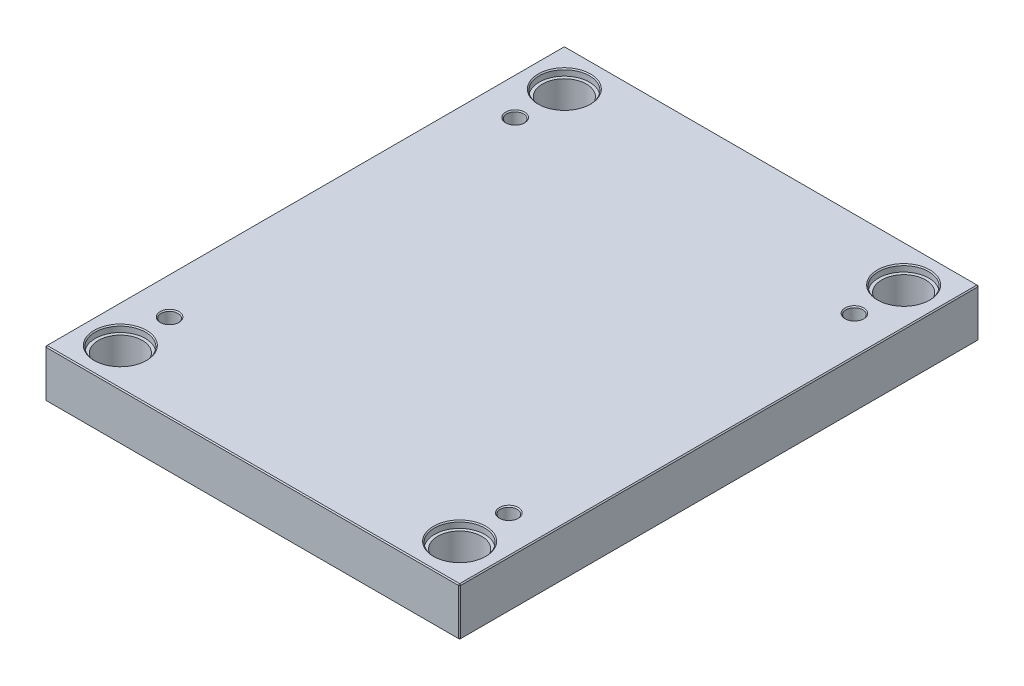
ISO-10303-21;
HEADER;
FILE_DESCRIPTION(('STEP AP214'),'2;1');
FILE_NAME('part.step','',(''),(''),'','','');
FILE_SCHEMA(('AUTOMOTIVE_DESIGN { 1 0 10303 214 1 1 1 1 }'));
ENDSEC;
DATA;
#1=APPLICATION_CONTEXT('core data for automotive mechanical design processes');
#2=APPLICATION_PROTOCOL_DEFINITION('international standard','automotive_design',2000,#1);
#3=PRODUCT_CONTEXT('',#1,'mechanical');
#4=PRODUCT('Part','Part','',(#3));
#5=PRODUCT_RELATED_PRODUCT_CATEGORY('part','',(#4));
#6=PRODUCT_DEFINITION_FORMATION('','',#4);
#7=PRODUCT_DEFINITION_CONTEXT('part definition',#1,'design');
#8=PRODUCT_DEFINITION('design','',#6,#7);
#9=PRODUCT_DEFINITION_SHAPE('','',#8);
#10=(LENGTH_UNIT() NAMED_UNIT(*) SI_UNIT(.MILLI.,.METRE.));
#11=(NAMED_UNIT(*) PLANE_ANGLE_UNIT() SI_UNIT($,.RADIAN.));
#12=(NAMED_UNIT(*) SI_UNIT($,.STERADIAN.) SOLID_ANGLE_UNIT());
#13=UNCERTAINTY_MEASURE_WITH_UNIT(LENGTH_MEASURE(1.E-05),#10,'distance_accuracy_value','');
#14=(GEOMETRIC_REPRESENTATION_CONTEXT(3) GLOBAL_UNCERTAINTY_ASSIGNED_CONTEXT((#13)) GLOBAL_UNIT_ASSIGNED_CONTEXT((#10,
#11,#12)) REPRESENTATION_CONTEXT('',''));
#15=CARTESIAN_POINT('',(0.,0.,0.));
#16=DIRECTION('',(0.,0.,1.));
#17=DIRECTION('',(1.,0.,0.));
#18=AXIS2_PLACEMENT_3D('',#15,#16,#17);
#19=CARTESIAN_POINT('',(-162.,0.,-212.));
#20=DIRECTION('',(0.,1.,0.));
#21=DIRECTION('',(0.,0.,1.));
#22=AXIS2_PLACEMENT_3D('',#19,#20,#21);
#23=CYLINDRICAL_SURFACE('',#22,21.);
#24=CARTESIAN_POINT('',(-162.,0.999999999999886,-212.));
#25=DIRECTION('',(0.,1.,0.));
#26=DIRECTION('',(0.,0.,1.));
#27=AXIS2_PLACEMENT_3D('',#24,#25,#26);
#28=CIRCLE('',#27,21.);
#29=CARTESIAN_POINT('',(-162.,0.999999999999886,-191.));
#30=VERTEX_POINT('',#29);
#31=EDGE_CURVE('E472',#30,#30,#28,.F.);
#32=ORIENTED_EDGE('',*,*,#31,.T.);
#33=EDGE_LOOP('',(#32));
#34=FACE_BOUND('',#33,.T.);
#35=CARTESIAN_POINT('',(-162.,39.7,-212.));
#36=DIRECTION('',(0.,1.,0.));
#37=DIRECTION('',(0.,0.,1.));
#38=AXIS2_PLACEMENT_3D('',#35,#36,#37);
#39=CIRCLE('',#38,21.);
#40=CARTESIAN_POINT('',(-162.,39.7,-191.));
#41=VERTEX_POINT('',#40);
#42=EDGE_CURVE('E221',#41,#41,#39,.F.);
#43=ORIENTED_EDGE('',*,*,#42,.F.);
#44=EDGE_LOOP('',(#43));
#45=FACE_BOUND('',#44,.T.);
#46=ADVANCED_FACE('F16',(#34,#45),#23,.F.);
#47=CARTESIAN_POINT('',(162.,0.,-212.));
#48=DIRECTION('',(0.,1.,0.));
#49=DIRECTION('',(0.,0.,1.));
#50=AXIS2_PLACEMENT_3D('',#47,#48,#49);
#51=CYLINDRICAL_SURFACE('',#50,21.);
#52=CARTESIAN_POINT('',(162.,0.999999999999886,-212.));
#53=DIRECTION('',(0.,1.,0.));
#54=DIRECTION('',(0.,0.,1.));
#55=AXIS2_PLACEMENT_3D('',#52,#53,#54);
#56=CIRCLE('',#55,21.);
#57=CARTESIAN_POINT('',(162.,0.999999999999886,-191.));
#58=VERTEX_POINT('',#57);
#59=EDGE_CURVE('E474',#58,#58,#56,.F.);
#60=ORIENTED_EDGE('',*,*,#59,.T.);
#61=EDGE_LOOP('',(#60));
#62=FACE_BOUND('',#61,.T.);
#63=CARTESIAN_POINT('',(162.,39.7,-212.));
#64=DIRECTION('',(0.,1.,0.));
#65=DIRECTION('',(0.,0.,1.));
#66=AXIS2_PLACEMENT_3D('',#63,#64,#65);
#67=CIRCLE('',#66,21.);
#68=CARTESIAN_POINT('',(162.,39.7,-191.));
#69=VERTEX_POINT('',#68);
#70=EDGE_CURVE('E218',#69,#69,#67,.F.);
#71=ORIENTED_EDGE('',*,*,#70,.F.);
#72=EDGE_LOOP('',(#71));
#73=FACE_BOUND('',#72,.T.);
#74=ADVANCED_FACE('F263',(#62,#73),#51,.F.);
#75=CARTESIAN_POINT('',(162.,0.,212.));
#76=DIRECTION('',(0.,1.,0.));
#77=DIRECTION('',(0.,0.,1.));
#78=AXIS2_PLACEMENT_3D('',#75,#76,#77);
#79=CYLINDRICAL_SURFACE('',#78,21.);
#80=CARTESIAN_POINT('',(162.,0.999999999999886,212.));
#81=DIRECTION('',(0.,1.,0.));
#82=DIRECTION('',(0.,0.,1.));
#83=AXIS2_PLACEMENT_3D('',#80,#81,#82);
#84=CIRCLE('',#83,21.);
#85=CARTESIAN_POINT('',(162.,0.999999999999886,233.));
#86=VERTEX_POINT('',#85);
#87=EDGE_CURVE('E477',#86,#86,#84,.F.);
#88=ORIENTED_EDGE('',*,*,#87,.T.);
#89=EDGE_LOOP('',(#88));
#90=FACE_BOUND('',#89,.T.);
#91=CARTESIAN_POINT('',(162.,39.7,212.));
#92=DIRECTION('',(0.,1.,0.));
#93=DIRECTION('',(0.,0.,1.));
#94=AXIS2_PLACEMENT_3D('',#91,#92,#93);
#95=CIRCLE('',#94,21.);
#96=CARTESIAN_POINT('',(162.,39.7,233.));
#97=VERTEX_POINT('',#96);
#98=EDGE_CURVE('E214',#97,#97,#95,.F.);
#99=ORIENTED_EDGE('',*,*,#98,.F.);
#100=EDGE_LOOP('',(#99));
#101=FACE_BOUND('',#100,.T.);
#102=ADVANCED_FACE('F270',(#90,#101),#79,.F.);
#103=CARTESIAN_POINT('',(-162.,0.,212.));
#104=DIRECTION('',(0.,1.,0.));
#105=DIRECTION('',(0.,0.,1.));
#106=AXIS2_PLACEMENT_3D('',#103,#104,#105);
#107=CYLINDRICAL_SURFACE('',#106,21.);
#108=CARTESIAN_POINT('',(-162.,0.999999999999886,212.));
#109=DIRECTION('',(0.,1.,0.));
#110=DIRECTION('',(0.,0.,1.));
#111=AXIS2_PLACEMENT_3D('',#108,#109,#110);
#112=CIRCLE('',#111,21.);
#113=CARTESIAN_POINT('',(-162.,0.999999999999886,233.));
#114=VERTEX_POINT('',#113);
#115=EDGE_CURVE('E480',#114,#114,#112,.F.);
#116=ORIENTED_EDGE('',*,*,#115,.T.);
#117=EDGE_LOOP('',(#116));
#118=FACE_BOUND('',#117,.T.);
#119=CARTESIAN_POINT('',(-162.,39.7,212.));
#120=DIRECTION('',(0.,1.,0.));
#121=DIRECTION('',(0.,0.,1.));
#122=AXIS2_PLACEMENT_3D('',#119,#120,#121);
#123=CIRCLE('',#122,21.);
#124=CARTESIAN_POINT('',(-162.,39.7,233.));
#125=VERTEX_POINT('',#124);
#126=EDGE_CURVE('E211',#125,#125,#123,.F.);
#127=ORIENTED_EDGE('',*,*,#126,.F.);
#128=EDGE_LOOP('',(#127));
#129=FACE_BOUND('',#128,.T.);
#130=ADVANCED_FACE('F277',(#118,#129),#107,.F.);
#131=CARTESIAN_POINT('',(-198.,46.,248.));
#132=DIRECTION('',(1.,0.,0.));
#133=DIRECTION('',(0.,0.,-1.));
#134=AXIS2_PLACEMENT_3D('',#131,#132,#133);
#135=PLANE('',#134);
#136=DIRECTION('',(0.,-1.,0.));
#137=VECTOR('',#136,1.);
#138=CARTESIAN_POINT('',(-198.,46.,-247.));
#139=LINE('',#138,#137);
#140=CARTESIAN_POINT('',(-198.,45.,-247.));
#141=VERTEX_POINT('',#140);
#142=CARTESIAN_POINT('',(-198.,1.,-247.));
#143=VERTEX_POINT('',#142);
#144=EDGE_CURVE('E487',#141,#143,#139,.T.);
#145=ORIENTED_EDGE('',*,*,#144,.T.);
#146=DIRECTION('',(0.,0.,1.));
#147=VECTOR('',#146,1.);
#148=CARTESIAN_POINT('',(-198.,1.,248.));
#149=LINE('',#148,#147);
#150=CARTESIAN_POINT('',(-198.,1.,247.));
#151=VERTEX_POINT('',#150);
#152=EDGE_CURVE('E490',#143,#151,#149,.T.);
#153=ORIENTED_EDGE('',*,*,#152,.T.);
#154=DIRECTION('',(0.,1.,0.));
#155=VECTOR('',#154,1.);
#156=CARTESIAN_POINT('',(-198.,46.,247.));
#157=LINE('',#156,#155);
#158=CARTESIAN_POINT('',(-198.,45.,247.));
#159=VERTEX_POINT('',#158);
#160=EDGE_CURVE('E485',#151,#159,#157,.T.);
#161=ORIENTED_EDGE('',*,*,#160,.T.);
#162=DIRECTION('',(0.,0.,-1.));
#163=VECTOR('',#162,1.);
#164=CARTESIAN_POINT('',(-198.,45.,-248.));
#165=LINE('',#164,#163);
#166=EDGE_CURVE('E483',#159,#141,#165,.T.);
#167=ORIENTED_EDGE('',*,*,#166,.T.);
#168=EDGE_LOOP('',(#145,#153,#161,#167));
#169=FACE_BOUND('',#168,.T.);
#170=ADVANCED_FACE('F298',(#169),#135,.F.);
#171=CARTESIAN_POINT('',(198.,46.,248.));
#172=DIRECTION('',(0.,0.,-1.));
#173=DIRECTION('',(-1.,0.,0.));
#174=AXIS2_PLACEMENT_3D('',#171,#172,#173);
#175=PLANE('',#174);
#176=DIRECTION('',(-1.,0.,0.));
#177=VECTOR('',#176,1.);
#178=CARTESIAN_POINT('',(-198.,45.,248.));
#179=LINE('',#178,#177);
#180=CARTESIAN_POINT('',(197.,45.,248.));
#181=VERTEX_POINT('',#180);
#182=CARTESIAN_POINT('',(-197.,45.,248.));
#183=VERTEX_POINT('',#182);
#184=EDGE_CURVE('E509',#181,#183,#179,.T.);
#185=ORIENTED_EDGE('',*,*,#184,.T.);
#186=DIRECTION('',(0.,-1.,0.));
#187=VECTOR('',#186,1.);
#188=CARTESIAN_POINT('',(-197.,46.,248.));
#189=LINE('',#188,#187);
#190=CARTESIAN_POINT('',(-197.,1.,248.));
#191=VERTEX_POINT('',#190);
#192=EDGE_CURVE('E515',#183,#191,#189,.T.);
#193=ORIENTED_EDGE('',*,*,#192,.T.);
#194=DIRECTION('',(1.,0.,0.));
#195=VECTOR('',#194,1.);
#196=CARTESIAN_POINT('',(198.,1.,248.));
#197=LINE('',#196,#195);
#198=CARTESIAN_POINT('',(197.,1.,248.));
#199=VERTEX_POINT('',#198);
#200=EDGE_CURVE('E513',#191,#199,#197,.T.);
#201=ORIENTED_EDGE('',*,*,#200,.T.);
#202=DIRECTION('',(0.,1.,0.));
#203=VECTOR('',#202,1.);
#204=CARTESIAN_POINT('',(197.,46.,248.));
#205=LINE('',#204,#203);
#206=EDGE_CURVE('E511',#199,#181,#205,.T.);
#207=ORIENTED_EDGE('',*,*,#206,.T.);
#208=EDGE_LOOP('',(#185,#193,#201,#207));
#209=FACE_BOUND('',#208,.T.);
#210=ADVANCED_FACE('F294',(#209),#175,.F.);
#211=CARTESIAN_POINT('',(198.,46.,248.));
#212=DIRECTION('',(-1.,0.,0.));
#213=DIRECTION('',(0.,0.,1.));
#214=AXIS2_PLACEMENT_3D('',#211,#212,#213);
#215=PLANE('',#214);
#216=DIRECTION('',(0.,0.,-1.));
#217=VECTOR('',#216,1.);
#218=CARTESIAN_POINT('',(198.,1.,248.));
#219=LINE('',#218,#217);
#220=CARTESIAN_POINT('',(198.,1.,247.));
#221=VERTEX_POINT('',#220);
#222=CARTESIAN_POINT('',(198.,1.,-247.));
#223=VERTEX_POINT('',#222);
#224=EDGE_CURVE('E504',#221,#223,#219,.T.);
#225=ORIENTED_EDGE('',*,*,#224,.T.);
#226=DIRECTION('',(0.,1.,0.));
#227=VECTOR('',#226,1.);
#228=CARTESIAN_POINT('',(198.,46.,-247.));
#229=LINE('',#228,#227);
#230=CARTESIAN_POINT('',(198.,45.,-247.));
#231=VERTEX_POINT('',#230);
#232=EDGE_CURVE('E506',#223,#231,#229,.T.);
#233=ORIENTED_EDGE('',*,*,#232,.T.);
#234=DIRECTION('',(0.,0.,1.));
#235=VECTOR('',#234,1.);
#236=CARTESIAN_POINT('',(198.,45.,248.));
#237=LINE('',#236,#235);
#238=CARTESIAN_POINT('',(198.,45.,247.));
#239=VERTEX_POINT('',#238);
#240=EDGE_CURVE('E500',#231,#239,#237,.T.);
#241=ORIENTED_EDGE('',*,*,#240,.T.);
#242=DIRECTION('',(0.,-1.,0.));
#243=VECTOR('',#242,1.);
#244=CARTESIAN_POINT('',(198.,46.,247.));
#245=LINE('',#244,#243);
#246=EDGE_CURVE('E502',#239,#221,#245,.T.);
#247=ORIENTED_EDGE('',*,*,#246,.T.);
#248=EDGE_LOOP('',(#225,#233,#241,#247));
#249=FACE_BOUND('',#248,.T.);
#250=ADVANCED_FACE('F290',(#249),#215,.F.);
#251=CARTESIAN_POINT('',(198.,46.,-248.));
#252=DIRECTION('',(0.,0.,1.));
#253=DIRECTION('',(1.,0.,0.));
#254=AXIS2_PLACEMENT_3D('',#251,#252,#253);
#255=PLANE('',#254);
#256=DIRECTION('',(0.,-1.,0.));
#257=VECTOR('',#256,1.);
#258=CARTESIAN_POINT('',(197.,46.,-248.));
#259=LINE('',#258,#257);
#260=CARTESIAN_POINT('',(197.,45.,-248.));
#261=VERTEX_POINT('',#260);
#262=CARTESIAN_POINT('',(197.,1.,-248.));
#263=VERTEX_POINT('',#262);
#264=EDGE_CURVE('E494',#261,#263,#259,.T.);
#265=ORIENTED_EDGE('',*,*,#264,.T.);
#266=DIRECTION('',(-1.,0.,0.));
#267=VECTOR('',#266,1.);
#268=CARTESIAN_POINT('',(198.,1.,-248.));
#269=LINE('',#268,#267);
#270=CARTESIAN_POINT('',(-197.,1.,-248.));
#271=VERTEX_POINT('',#270);
#272=EDGE_CURVE('E138',#263,#271,#269,.T.);
#273=ORIENTED_EDGE('',*,*,#272,.T.);
#274=DIRECTION('',(0.,1.,0.));
#275=VECTOR('',#274,1.);
#276=CARTESIAN_POINT('',(-197.,46.,-248.));
#277=LINE('',#276,#275);
#278=CARTESIAN_POINT('',(-197.,45.,-248.));
#279=VERTEX_POINT('',#278);
#280=EDGE_CURVE('E496',#271,#279,#277,.T.);
#281=ORIENTED_EDGE('',*,*,#280,.T.);
#282=DIRECTION('',(1.,0.,0.));
#283=VECTOR('',#282,1.);
#284=CARTESIAN_POINT('',(198.,45.,-248.));
#285=LINE('',#284,#283);
#286=EDGE_CURVE('E492',#279,#261,#285,.T.);
#287=ORIENTED_EDGE('',*,*,#286,.T.);
#288=EDGE_LOOP('',(#265,#273,#281,#287));
#289=FACE_BOUND('',#288,.T.);
#290=ADVANCED_FACE('F282',(#289),#255,.F.);
#291=CARTESIAN_POINT('',(0.,46.,0.));
#292=DIRECTION('',(0.,1.,0.));
#293=DIRECTION('',(0.,0.,1.));
#294=AXIS2_PLACEMENT_3D('',#291,#292,#293);
#295=PLANE('',#294);
#296=CARTESIAN_POINT('',(162.,46.,212.));
#297=DIRECTION('',(0.,1.,0.));
#298=DIRECTION('',(0.,0.,1.));
#299=AXIS2_PLACEMENT_3D('',#296,#297,#298);
#300=CIRCLE('',#299,25.);
#301=CARTESIAN_POINT('',(162.,46.,237.));
#302=VERTEX_POINT('',#301);
#303=EDGE_CURVE('E236',#302,#302,#300,.F.);
#304=ORIENTED_EDGE('',*,*,#303,.T.);
#305=EDGE_LOOP('',(#304));
#306=FACE_BOUND('',#305,.T.);
#307=CARTESIAN_POINT('',(-162.,46.,212.));
#308=DIRECTION('',(0.,1.,0.));
#309=DIRECTION('',(0.,0.,1.));
#310=AXIS2_PLACEMENT_3D('',#307,#308,#309);
#311=CIRCLE('',#310,25.);
#312=CARTESIAN_POINT('',(-162.,46.,237.));
#313=VERTEX_POINT('',#312);
#314=EDGE_CURVE('E233',#313,#313,#311,.F.);
#315=ORIENTED_EDGE('',*,*,#314,.T.);
#316=EDGE_LOOP('',(#315));
#317=FACE_BOUND('',#316,.T.);
#318=CARTESIAN_POINT('',(162.,46.,-212.));
#319=DIRECTION('',(0.,1.,0.));
#320=DIRECTION('',(0.,0.,1.));
#321=AXIS2_PLACEMENT_3D('',#318,#319,#320);
#322=CIRCLE('',#321,25.);
#323=CARTESIAN_POINT('',(162.,46.,-187.));
#324=VERTEX_POINT('',#323);
#325=EDGE_CURVE('E230',#324,#324,#322,.F.);
#326=ORIENTED_EDGE('',*,*,#325,.T.);
#327=EDGE_LOOP('',(#326));
#328=FACE_BOUND('',#327,.T.);
#329=CARTESIAN_POINT('',(-162.,46.,-212.));
#330=DIRECTION('',(0.,1.,0.));
#331=DIRECTION('',(0.,0.,1.));
#332=AXIS2_PLACEMENT_3D('',#329,#330,#331);
#333=CIRCLE('',#332,25.);
#334=CARTESIAN_POINT('',(-162.,46.,-187.));
#335=VERTEX_POINT('',#334);
#336=EDGE_CURVE('E227',#335,#335,#333,.F.);
#337=ORIENTED_EDGE('',*,*,#336,.T.);
#338=EDGE_LOOP('',(#337));
#339=FACE_BOUND('',#338,.T.);
#340=CARTESIAN_POINT('',(-162.,46.,165.));
#341=DIRECTION('',(0.,1.,0.));
#342=DIRECTION('',(0.,0.,1.));
#343=AXIS2_PLACEMENT_3D('',#340,#341,#342);
#344=CIRCLE('',#343,9.);
#345=CARTESIAN_POINT('',(-162.,46.,174.));
#346=VERTEX_POINT('',#345);
#347=EDGE_CURVE('E198',#346,#346,#344,.F.);
#348=ORIENTED_EDGE('',*,*,#347,.T.);
#349=EDGE_LOOP('',(#348));
#350=FACE_BOUND('',#349,.T.);
#351=CARTESIAN_POINT('',(162.,46.,165.));
#352=DIRECTION('',(0.,1.,0.));
#353=DIRECTION('',(0.,0.,1.));
#354=AXIS2_PLACEMENT_3D('',#351,#352,#353);
#355=CIRCLE('',#354,9.);
#356=CARTESIAN_POINT('',(162.,46.,174.));
#357=VERTEX_POINT('',#356);
#358=EDGE_CURVE('E195',#357,#357,#355,.F.);
#359=ORIENTED_EDGE('',*,*,#358,.T.);
#360=EDGE_LOOP('',(#359));
#361=FACE_BOUND('',#360,.T.);
#362=CARTESIAN_POINT('',(162.,46.,-165.));
#363=DIRECTION('',(0.,1.,0.));
#364=DIRECTION('',(0.,0.,1.));
#365=AXIS2_PLACEMENT_3D('',#362,#363,#364);
#366=CIRCLE('',#365,9.);
#367=CARTESIAN_POINT('',(162.,46.,-156.));
#368=VERTEX_POINT('',#367);
#369=EDGE_CURVE('E192',#368,#368,#366,.F.);
#370=ORIENTED_EDGE('',*,*,#369,.T.);
#371=EDGE_LOOP('',(#370));
#372=FACE_BOUND('',#371,.T.);
#373=CARTESIAN_POINT('',(-162.,46.,-165.));
#374=DIRECTION('',(0.,1.,0.));
#375=DIRECTION('',(0.,0.,1.));
#376=AXIS2_PLACEMENT_3D('',#373,#374,#375);
#377=CIRCLE('',#376,9.);
#378=CARTESIAN_POINT('',(-162.,46.,-156.));
#379=VERTEX_POINT('',#378);
#380=EDGE_CURVE('E188',#379,#379,#377,.F.);
#381=ORIENTED_EDGE('',*,*,#380,.T.);
#382=EDGE_LOOP('',(#381));
#383=FACE_BOUND('',#382,.T.);
#384=DIRECTION('',(0.,0.,-1.));
#385=VECTOR('',#384,1.);
#386=CARTESIAN_POINT('',(197.,46.,-248.));
#387=LINE('',#386,#385);
#388=CARTESIAN_POINT('',(197.,46.,247.));
#389=VERTEX_POINT('',#388);
#390=CARTESIAN_POINT('',(197.,46.,-247.));
#391=VERTEX_POINT('',#390);
#392=EDGE_CURVE('E31',#389,#391,#387,.T.);
#393=ORIENTED_EDGE('',*,*,#392,.T.);
#394=DIRECTION('',(-1.,0.,0.));
#395=VECTOR('',#394,1.);
#396=CARTESIAN_POINT('',(-198.,46.,-247.));
#397=LINE('',#396,#395);
#398=CARTESIAN_POINT('',(-197.,46.,-247.));
#399=VERTEX_POINT('',#398);
#400=EDGE_CURVE('E189',#391,#399,#397,.T.);
#401=ORIENTED_EDGE('',*,*,#400,.T.);
#402=DIRECTION('',(0.,0.,1.));
#403=VECTOR('',#402,1.);
#404=CARTESIAN_POINT('',(-197.,46.,248.));
#405=LINE('',#404,#403);
#406=CARTESIAN_POINT('',(-197.,46.,247.));
#407=VERTEX_POINT('',#406);
#408=EDGE_CURVE('E518',#399,#407,#405,.T.);
#409=ORIENTED_EDGE('',*,*,#408,.T.);
#410=DIRECTION('',(1.,0.,0.));
#411=VECTOR('',#410,1.);
#412=CARTESIAN_POINT('',(198.,46.,247.));
#413=LINE('',#412,#411);
#414=EDGE_CURVE('E36',#407,#389,#413,.T.);
#415=ORIENTED_EDGE('',*,*,#414,.T.);
#416=EDGE_LOOP('',(#393,#401,#409,#415));
#417=FACE_BOUND('',#416,.T.);
#418=ADVANCED_FACE('F279',(#306,#317,#328,#339,#350,#361,#372,#383,#417),#295,.T.);
#419=CARTESIAN_POINT('',(0.,0.,0.));
#420=DIRECTION('',(0.,1.,0.));
#421=DIRECTION('',(0.,0.,1.));
#422=AXIS2_PLACEMENT_3D('',#419,#420,#421);
#423=PLANE('',#422);
#424=CARTESIAN_POINT('',(-162.,0.,-212.));
#425=DIRECTION('',(0.,1.,0.));
#426=DIRECTION('',(0.,0.,1.));
#427=AXIS2_PLACEMENT_3D('',#424,#425,#426);
#428=CIRCLE('',#427,22.);
#429=CARTESIAN_POINT('',(-162.,0.,-190.));
#430=VERTEX_POINT('',#429);
#431=EDGE_CURVE('E469',#430,#430,#428,.T.);
#432=ORIENTED_EDGE('',*,*,#431,.T.);
#433=EDGE_LOOP('',(#432));
#434=FACE_BOUND('',#433,.T.);
#435=CARTESIAN_POINT('',(162.,0.,-212.));
#436=DIRECTION('',(0.,1.,0.));
#437=DIRECTION('',(0.,0.,1.));
#438=AXIS2_PLACEMENT_3D('',#435,#436,#437);
#439=CIRCLE('',#438,22.);
#440=CARTESIAN_POINT('',(162.,0.,-190.));
#441=VERTEX_POINT('',#440);
#442=EDGE_CURVE('E466',#441,#441,#439,.T.);
#443=ORIENTED_EDGE('',*,*,#442,.T.);
#444=EDGE_LOOP('',(#443));
#445=FACE_BOUND('',#444,.T.);
#446=CARTESIAN_POINT('',(162.,0.,212.));
#447=DIRECTION('',(0.,1.,0.));
#448=DIRECTION('',(0.,0.,1.));
#449=AXIS2_PLACEMENT_3D('',#446,#447,#448);
#450=CIRCLE('',#449,22.);
#451=CARTESIAN_POINT('',(162.,0.,234.));
#452=VERTEX_POINT('',#451);
#453=EDGE_CURVE('E463',#452,#452,#450,.T.);
#454=ORIENTED_EDGE('',*,*,#453,.T.);
#455=EDGE_LOOP('',(#454));
#456=FACE_BOUND('',#455,.T.);
#457=CARTESIAN_POINT('',(-162.,0.,212.));
#458=DIRECTION('',(0.,1.,0.));
#459=DIRECTION('',(0.,0.,1.));
#460=AXIS2_PLACEMENT_3D('',#457,#458,#459);
#461=CIRCLE('',#460,22.);
#462=CARTESIAN_POINT('',(-162.,0.,234.));
#463=VERTEX_POINT('',#462);
#464=EDGE_CURVE('E460',#463,#463,#461,.T.);
#465=ORIENTED_EDGE('',*,*,#464,.T.);
#466=EDGE_LOOP('',(#465));
#467=FACE_BOUND('',#466,.T.);
#468=DIRECTION('',(0.,0.,1.));
#469=VECTOR('',#468,1.);
#470=CARTESIAN_POINT('',(197.,0.,0.));
#471=LINE('',#470,#469);
#472=CARTESIAN_POINT('',(197.,0.,-247.));
#473=VERTEX_POINT('',#472);
#474=CARTESIAN_POINT('',(197.,0.,247.));
#475=VERTEX_POINT('',#474);
#476=EDGE_CURVE('E108',#473,#475,#471,.T.);
#477=ORIENTED_EDGE('',*,*,#476,.T.);
#478=DIRECTION('',(-1.,0.,0.));
#479=VECTOR('',#478,1.);
#480=CARTESIAN_POINT('',(0.,0.,247.));
#481=LINE('',#480,#479);
#482=CARTESIAN_POINT('',(-197.,0.,247.));
#483=VERTEX_POINT('',#482);
#484=EDGE_CURVE('E458',#475,#483,#481,.T.);
#485=ORIENTED_EDGE('',*,*,#484,.T.);
#486=DIRECTION('',(0.,0.,-1.));
#487=VECTOR('',#486,1.);
#488=CARTESIAN_POINT('',(-197.,0.,0.));
#489=LINE('',#488,#487);
#490=CARTESIAN_POINT('',(-197.,0.,-247.));
#491=VERTEX_POINT('',#490);
#492=EDGE_CURVE('E110',#483,#491,#489,.T.);
#493=ORIENTED_EDGE('',*,*,#492,.T.);
#494=DIRECTION('',(1.,0.,0.));
#495=VECTOR('',#494,1.);
#496=CARTESIAN_POINT('',(0.,0.,-247.));
#497=LINE('',#496,#495);
#498=EDGE_CURVE('E104',#491,#473,#497,.T.);
#499=ORIENTED_EDGE('',*,*,#498,.T.);
#500=EDGE_LOOP('',(#477,#485,#493,#499));
#501=FACE_BOUND('',#500,.T.);
#502=ADVANCED_FACE('F106',(#434,#445,#456,#467,#501),#423,.F.);
#503=CARTESIAN_POINT('',(-162.,0.,-212.));
#504=DIRECTION('',(0.,-1.,0.));
#505=DIRECTION('',(0.,0.,-1.));
#506=AXIS2_PLACEMENT_3D('',#503,#504,#505);
#507=CONICAL_SURFACE('',#506,22.,0.785398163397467);
#508=ORIENTED_EDGE('',*,*,#31,.F.);
#509=EDGE_LOOP('',(#508));
#510=FACE_BOUND('',#509,.T.);
#511=ORIENTED_EDGE('',*,*,#431,.F.);
#512=EDGE_LOOP('',(#511));
#513=FACE_BOUND('',#512,.T.);
#514=ADVANCED_FACE('F286',(#510,#513),#507,.F.);
#515=CARTESIAN_POINT('',(162.,0.,-212.));
#516=DIRECTION('',(0.,-1.,0.));
#517=DIRECTION('',(0.,0.,-1.));
#518=AXIS2_PLACEMENT_3D('',#515,#516,#517);
#519=CONICAL_SURFACE('',#518,22.,0.785398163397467);
#520=ORIENTED_EDGE('',*,*,#59,.F.);
#521=EDGE_LOOP('',(#520));
#522=FACE_BOUND('',#521,.T.);
#523=ORIENTED_EDGE('',*,*,#442,.F.);
#524=EDGE_LOOP('',(#523));
#525=FACE_BOUND('',#524,.T.);
#526=ADVANCED_FACE('F305',(#522,#525),#519,.F.);
#527=CARTESIAN_POINT('',(162.,0.,212.));
#528=DIRECTION('',(0.,-1.,0.));
#529=DIRECTION('',(0.,0.,-1.));
#530=AXIS2_PLACEMENT_3D('',#527,#528,#529);
#531=CONICAL_SURFACE('',#530,22.,0.785398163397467);
#532=ORIENTED_EDGE('',*,*,#87,.F.);
#533=EDGE_LOOP('',(#532));
#534=FACE_BOUND('',#533,.T.);
#535=ORIENTED_EDGE('',*,*,#453,.F.);
#536=EDGE_LOOP('',(#535));
#537=FACE_BOUND('',#536,.T.);
#538=ADVANCED_FACE('F309',(#534,#537),#531,.F.);
#539=CARTESIAN_POINT('',(-162.,0.,212.));
#540=DIRECTION('',(0.,-1.,0.));
#541=DIRECTION('',(0.,0.,-1.));
#542=AXIS2_PLACEMENT_3D('',#539,#540,#541);
#543=CONICAL_SURFACE('',#542,22.,0.785398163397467);
#544=ORIENTED_EDGE('',*,*,#115,.F.);
#545=EDGE_LOOP('',(#544));
#546=FACE_BOUND('',#545,.T.);
#547=ORIENTED_EDGE('',*,*,#464,.F.);
#548=EDGE_LOOP('',(#547));
#549=FACE_BOUND('',#548,.T.);
#550=ADVANCED_FACE('F313',(#546,#549),#543,.F.);
#551=CARTESIAN_POINT('',(198.,46.,247.));
#552=DIRECTION('',(-0.707106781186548,0.,-0.707106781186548));
#553=DIRECTION('',(0.,-1.,0.));
#554=AXIS2_PLACEMENT_3D('',#551,#552,#553);
#555=PLANE('',#554);
#556=DIRECTION('',(-0.707106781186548,0.,0.707106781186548));
#557=VECTOR('',#556,1.);
#558=CARTESIAN_POINT('',(197.,45.,248.));
#559=LINE('',#558,#557);
#560=EDGE_CURVE('E126',#181,#239,#559,.F.);
#561=ORIENTED_EDGE('',*,*,#560,.F.);
#562=ORIENTED_EDGE('',*,*,#206,.F.);
#563=DIRECTION('',(0.707106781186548,0.,-0.707106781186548));
#564=VECTOR('',#563,1.);
#565=CARTESIAN_POINT('',(197.,1.,248.));
#566=LINE('',#565,#564);
#567=EDGE_CURVE('E180',#221,#199,#566,.F.);
#568=ORIENTED_EDGE('',*,*,#567,.F.);
#569=ORIENTED_EDGE('',*,*,#246,.F.);
#570=EDGE_LOOP('',(#561,#562,#568,#569));
#571=FACE_BOUND('',#570,.T.);
#572=ADVANCED_FACE('F317',(#571),#555,.F.);
#573=CARTESIAN_POINT('',(197.,45.,248.));
#574=DIRECTION('',(0.577350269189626,0.577350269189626,0.577350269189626));
#575=DIRECTION('',(0.707106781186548,0.,-0.707106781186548));
#576=AXIS2_PLACEMENT_3D('',#573,#574,#575);
#577=PLANE('',#576);
#578=DIRECTION('',(0.,-0.707106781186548,0.707106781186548));
#579=VECTOR('',#578,1.);
#580=CARTESIAN_POINT('',(197.,45.,248.));
#581=LINE('',#580,#579);
#582=EDGE_CURVE('E175',#181,#389,#581,.F.);
#583=ORIENTED_EDGE('',*,*,#582,.F.);
#584=ORIENTED_EDGE('',*,*,#560,.T.);
#585=DIRECTION('',(-0.707106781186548,0.707106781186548,0.));
#586=VECTOR('',#585,1.);
#587=CARTESIAN_POINT('',(197.5,45.5,247.));
#588=LINE('',#587,#586);
#589=EDGE_CURVE('E177',#389,#239,#588,.F.);
#590=ORIENTED_EDGE('',*,*,#589,.F.);
#591=EDGE_LOOP('',(#583,#584,#590));
#592=FACE_BOUND('',#591,.T.);
#593=ADVANCED_FACE('F385',(#592),#577,.T.);
#594=CARTESIAN_POINT('',(197.,1.,248.));
#595=DIRECTION('',(0.577350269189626,-0.577350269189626,0.577350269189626));
#596=DIRECTION('',(0.707106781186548,0.,-0.707106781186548));
#597=AXIS2_PLACEMENT_3D('',#594,#595,#596);
#598=PLANE('',#597);
#599=DIRECTION('',(-0.707106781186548,-0.707106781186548,0.));
#600=VECTOR('',#599,1.);
#601=CARTESIAN_POINT('',(197.5,0.5,247.));
#602=LINE('',#601,#600);
#603=EDGE_CURVE('E124',#221,#475,#602,.T.);
#604=ORIENTED_EDGE('',*,*,#603,.F.);
#605=ORIENTED_EDGE('',*,*,#567,.T.);
#606=DIRECTION('',(0.,0.707106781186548,0.707106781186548));
#607=VECTOR('',#606,1.);
#608=CARTESIAN_POINT('',(197.,1.,248.));
#609=LINE('',#608,#607);
#610=EDGE_CURVE('E172',#475,#199,#609,.T.);
#611=ORIENTED_EDGE('',*,*,#610,.F.);
#612=EDGE_LOOP('',(#604,#605,#611));
#613=FACE_BOUND('',#612,.T.);
#614=ADVANCED_FACE('F381',(#613),#598,.T.);
#615=CARTESIAN_POINT('',(197.,46.,0.));
#616=DIRECTION('',(0.707106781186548,0.707106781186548,0.));
#617=DIRECTION('',(0.,0.,1.));
#618=AXIS2_PLACEMENT_3D('',#615,#616,#617);
#619=PLANE('',#618);
#620=ORIENTED_EDGE('',*,*,#589,.T.);
#621=ORIENTED_EDGE('',*,*,#240,.F.);
#622=DIRECTION('',(0.707106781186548,-0.707106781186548,0.));
#623=VECTOR('',#622,1.);
#624=CARTESIAN_POINT('',(198.,45.,-247.));
#625=LINE('',#624,#623);
#626=EDGE_CURVE('E166',#391,#231,#625,.T.);
#627=ORIENTED_EDGE('',*,*,#626,.F.);
#628=ORIENTED_EDGE('',*,*,#392,.F.);
#629=EDGE_LOOP('',(#620,#621,#627,#628));
#630=FACE_BOUND('',#629,.T.);
#631=ADVANCED_FACE('F377',(#630),#619,.T.);
#632=CARTESIAN_POINT('',(0.,46.,247.));
#633=DIRECTION('',(0.,0.707106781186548,0.707106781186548));
#634=DIRECTION('',(-1.,0.,0.));
#635=AXIS2_PLACEMENT_3D('',#632,#633,#634);
#636=PLANE('',#635);
#637=ORIENTED_EDGE('',*,*,#582,.T.);
#638=ORIENTED_EDGE('',*,*,#414,.F.);
#639=DIRECTION('',(0.,0.707106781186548,-0.707106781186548));
#640=VECTOR('',#639,1.);
#641=CARTESIAN_POINT('',(-197.,45.5,247.5));
#642=LINE('',#641,#640);
#643=EDGE_CURVE('E163',#183,#407,#642,.T.);
#644=ORIENTED_EDGE('',*,*,#643,.F.);
#645=ORIENTED_EDGE('',*,*,#184,.F.);
#646=EDGE_LOOP('',(#637,#638,#644,#645));
#647=FACE_BOUND('',#646,.T.);
#648=ADVANCED_FACE('F373',(#647),#636,.T.);
#649=CARTESIAN_POINT('',(-197.,46.,248.));
#650=DIRECTION('',(0.707106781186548,0.,-0.707106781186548));
#651=DIRECTION('',(0.,-1.,0.));
#652=AXIS2_PLACEMENT_3D('',#649,#650,#651);
#653=PLANE('',#652);
#654=DIRECTION('',(0.707106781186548,0.,0.707106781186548));
#655=VECTOR('',#654,1.);
#656=CARTESIAN_POINT('',(-197.,1.,248.));
#657=LINE('',#656,#655);
#658=EDGE_CURVE('E157',#191,#151,#657,.F.);
#659=ORIENTED_EDGE('',*,*,#658,.F.);
#660=ORIENTED_EDGE('',*,*,#192,.F.);
#661=DIRECTION('',(-0.707106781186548,0.,-0.707106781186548));
#662=VECTOR('',#661,1.);
#663=CARTESIAN_POINT('',(-198.,45.,247.));
#664=LINE('',#663,#662);
#665=EDGE_CURVE('E160',#159,#183,#664,.F.);
#666=ORIENTED_EDGE('',*,*,#665,.F.);
#667=ORIENTED_EDGE('',*,*,#160,.F.);
#668=EDGE_LOOP('',(#659,#660,#666,#667));
#669=FACE_BOUND('',#668,.T.);
#670=ADVANCED_FACE('F369',(#669),#653,.F.);
#671=CARTESIAN_POINT('',(198.,1.,248.));
#672=DIRECTION('',(0.,0.707106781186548,-0.707106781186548));
#673=DIRECTION('',(1.,0.,0.));
#674=AXIS2_PLACEMENT_3D('',#671,#672,#673);
#675=PLANE('',#674);
#676=ORIENTED_EDGE('',*,*,#610,.T.);
#677=ORIENTED_EDGE('',*,*,#200,.F.);
#678=DIRECTION('',(0.,-0.707106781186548,-0.707106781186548));
#679=VECTOR('',#678,1.);
#680=CARTESIAN_POINT('',(-197.,1.,248.));
#681=LINE('',#680,#679);
#682=EDGE_CURVE('E135',#483,#191,#681,.F.);
#683=ORIENTED_EDGE('',*,*,#682,.F.);
#684=ORIENTED_EDGE('',*,*,#484,.F.);
#685=EDGE_LOOP('',(#676,#677,#683,#684));
#686=FACE_BOUND('',#685,.T.);
#687=ADVANCED_FACE('F366',(#686),#675,.F.);
#688=CARTESIAN_POINT('',(198.,1.,248.));
#689=DIRECTION('',(-0.707106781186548,0.707106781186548,0.));
#690=DIRECTION('',(0.,0.,-1.));
#691=AXIS2_PLACEMENT_3D('',#688,#689,#690);
#692=PLANE('',#691);
#693=ORIENTED_EDGE('',*,*,#603,.T.);
#694=ORIENTED_EDGE('',*,*,#476,.F.);
#695=DIRECTION('',(0.707106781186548,0.707106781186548,0.));
#696=VECTOR('',#695,1.);
#697=CARTESIAN_POINT('',(197.5,0.500000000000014,-247.));
#698=LINE('',#697,#696);
#699=EDGE_CURVE('E121',#223,#473,#698,.F.);
#700=ORIENTED_EDGE('',*,*,#699,.F.);
#701=ORIENTED_EDGE('',*,*,#224,.F.);
#702=EDGE_LOOP('',(#693,#694,#700,#701));
#703=FACE_BOUND('',#702,.T.);
#704=ADVANCED_FACE('F119',(#703),#692,.F.);
#705=CARTESIAN_POINT('',(197.,46.,-248.));
#706=DIRECTION('',(-0.707106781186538,0.,0.707106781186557));
#707=DIRECTION('',(0.,-1.,0.));
#708=AXIS2_PLACEMENT_3D('',#705,#706,#707);
#709=PLANE('',#708);
#710=DIRECTION('',(0.707106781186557,0.,0.707106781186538));
#711=VECTOR('',#710,1.);
#712=CARTESIAN_POINT('',(198.,45.,-247.));
#713=LINE('',#712,#711);
#714=EDGE_CURVE('E168',#231,#261,#713,.F.);
#715=ORIENTED_EDGE('',*,*,#714,.F.);
#716=ORIENTED_EDGE('',*,*,#232,.F.);
#717=DIRECTION('',(-0.707106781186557,0.,-0.707106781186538));
#718=VECTOR('',#717,1.);
#719=CARTESIAN_POINT('',(197.,1.,-248.));
#720=LINE('',#719,#718);
#721=EDGE_CURVE('E134',#263,#223,#720,.F.);
#722=ORIENTED_EDGE('',*,*,#721,.F.);
#723=ORIENTED_EDGE('',*,*,#264,.F.);
#724=EDGE_LOOP('',(#715,#716,#722,#723));
#725=FACE_BOUND('',#724,.T.);
#726=ADVANCED_FACE('F359',(#725),#709,.F.);
#727=CARTESIAN_POINT('',(198.,45.,-247.));
#728=DIRECTION('',(0.577350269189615,0.577350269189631,-0.577350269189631));
#729=DIRECTION('',(0.,0.707106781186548,0.707106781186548));
#730=AXIS2_PLACEMENT_3D('',#727,#728,#729);
#731=PLANE('',#730);
#732=ORIENTED_EDGE('',*,*,#626,.T.);
#733=ORIENTED_EDGE('',*,*,#714,.T.);
#734=DIRECTION('',(0.,0.707106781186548,0.707106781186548));
#735=VECTOR('',#734,1.);
#736=CARTESIAN_POINT('',(197.,45.5,-247.5));
#737=LINE('',#736,#735);
#738=EDGE_CURVE('E152',#391,#261,#737,.F.);
#739=ORIENTED_EDGE('',*,*,#738,.F.);
#740=EDGE_LOOP('',(#732,#733,#739));
#741=FACE_BOUND('',#740,.T.);
#742=ADVANCED_FACE('F355',(#741),#731,.T.);
#743=CARTESIAN_POINT('',(-198.,45.,247.));
#744=DIRECTION('',(-0.577350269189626,0.577350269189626,0.577350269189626));
#745=DIRECTION('',(0.707106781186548,0.,0.707106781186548));
#746=AXIS2_PLACEMENT_3D('',#743,#744,#745);
#747=PLANE('',#746);
#748=ORIENTED_EDGE('',*,*,#665,.T.);
#749=ORIENTED_EDGE('',*,*,#643,.T.);
#750=DIRECTION('',(-0.707106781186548,-0.707106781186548,0.));
#751=VECTOR('',#750,1.);
#752=CARTESIAN_POINT('',(-198.,45.,247.));
#753=LINE('',#752,#751);
#754=EDGE_CURVE('E143',#159,#407,#753,.F.);
#755=ORIENTED_EDGE('',*,*,#754,.F.);
#756=EDGE_LOOP('',(#748,#749,#755));
#757=FACE_BOUND('',#756,.T.);
#758=ADVANCED_FACE('F351',(#757),#747,.T.);
#759=CARTESIAN_POINT('',(-197.,1.,248.));
#760=DIRECTION('',(-0.577350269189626,-0.577350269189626,0.577350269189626));
#761=DIRECTION('',(0.707106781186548,0.,0.707106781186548));
#762=AXIS2_PLACEMENT_3D('',#759,#760,#761);
#763=PLANE('',#762);
#764=ORIENTED_EDGE('',*,*,#682,.T.);
#765=ORIENTED_EDGE('',*,*,#658,.T.);
#766=DIRECTION('',(-0.707106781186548,0.707106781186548,0.));
#767=VECTOR('',#766,1.);
#768=CARTESIAN_POINT('',(-197.5,0.5,247.));
#769=LINE('',#768,#767);
#770=EDGE_CURVE('E139',#483,#151,#769,.T.);
#771=ORIENTED_EDGE('',*,*,#770,.F.);
#772=EDGE_LOOP('',(#764,#765,#771));
#773=FACE_BOUND('',#772,.T.);
#774=ADVANCED_FACE('F348',(#773),#763,.T.);
#775=CARTESIAN_POINT('',(197.,1.,-248.));
#776=DIRECTION('',(0.577350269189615,-0.577350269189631,-0.577350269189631));
#777=DIRECTION('',(0.,0.707106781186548,-0.707106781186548));
#778=AXIS2_PLACEMENT_3D('',#775,#776,#777);
#779=PLANE('',#778);
#780=ORIENTED_EDGE('',*,*,#721,.T.);
#781=ORIENTED_EDGE('',*,*,#699,.T.);
#782=DIRECTION('',(0.,-0.707106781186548,0.707106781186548));
#783=VECTOR('',#782,1.);
#784=CARTESIAN_POINT('',(197.,1.,-248.));
#785=LINE('',#784,#783);
#786=EDGE_CURVE('E131',#263,#473,#785,.T.);
#787=ORIENTED_EDGE('',*,*,#786,.F.);
#788=EDGE_LOOP('',(#780,#781,#787));
#789=FACE_BOUND('',#788,.T.);
#790=ADVANCED_FACE('F130',(#789),#779,.T.);
#791=CARTESIAN_POINT('',(0.,46.,-247.));
#792=DIRECTION('',(0.,0.707106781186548,-0.707106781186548));
#793=DIRECTION('',(1.,0.,0.));
#794=AXIS2_PLACEMENT_3D('',#791,#792,#793);
#795=PLANE('',#794);
#796=ORIENTED_EDGE('',*,*,#738,.T.);
#797=ORIENTED_EDGE('',*,*,#286,.F.);
#798=DIRECTION('',(0.,-0.707106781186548,-0.707106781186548));
#799=VECTOR('',#798,1.);
#800=CARTESIAN_POINT('',(-197.,45.,-248.));
#801=LINE('',#800,#799);
#802=EDGE_CURVE('E140',#399,#279,#801,.T.);
#803=ORIENTED_EDGE('',*,*,#802,.F.);
#804=ORIENTED_EDGE('',*,*,#400,.F.);
#805=EDGE_LOOP('',(#796,#797,#803,#804));
#806=FACE_BOUND('',#805,.T.);
#807=ADVANCED_FACE('F341',(#806),#795,.T.);
#808=CARTESIAN_POINT('',(-197.,46.,0.));
#809=DIRECTION('',(-0.707106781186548,0.707106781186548,0.));
#810=DIRECTION('',(0.,0.,-1.));
#811=AXIS2_PLACEMENT_3D('',#808,#809,#810);
#812=PLANE('',#811);
#813=ORIENTED_EDGE('',*,*,#754,.T.);
#814=ORIENTED_EDGE('',*,*,#408,.F.);
#815=DIRECTION('',(0.707106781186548,0.707106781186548,0.));
#816=VECTOR('',#815,1.);
#817=CARTESIAN_POINT('',(-197.5,45.5,-247.));
#818=LINE('',#817,#816);
#819=EDGE_CURVE('E146',#141,#399,#818,.T.);
#820=ORIENTED_EDGE('',*,*,#819,.F.);
#821=ORIENTED_EDGE('',*,*,#166,.F.);
#822=EDGE_LOOP('',(#813,#814,#820,#821));
#823=FACE_BOUND('',#822,.T.);
#824=ADVANCED_FACE('F337',(#823),#812,.T.);
#825=CARTESIAN_POINT('',(-198.,1.,248.));
#826=DIRECTION('',(0.707106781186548,0.707106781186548,0.));
#827=DIRECTION('',(0.,0.,1.));
#828=AXIS2_PLACEMENT_3D('',#825,#826,#827);
#829=PLANE('',#828);
#830=ORIENTED_EDGE('',*,*,#770,.T.);
#831=ORIENTED_EDGE('',*,*,#152,.F.);
#832=DIRECTION('',(0.707106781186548,-0.707106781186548,0.));
#833=VECTOR('',#832,1.);
#834=CARTESIAN_POINT('',(-198.,1.,-247.));
#835=LINE('',#834,#833);
#836=EDGE_CURVE('E529',#491,#143,#835,.F.);
#837=ORIENTED_EDGE('',*,*,#836,.F.);
#838=ORIENTED_EDGE('',*,*,#492,.F.);
#839=EDGE_LOOP('',(#830,#831,#837,#838));
#840=FACE_BOUND('',#839,.T.);
#841=ADVANCED_FACE('F334',(#840),#829,.F.);
#842=CARTESIAN_POINT('',(198.,1.,-248.));
#843=DIRECTION('',(0.,0.707106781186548,0.707106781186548));
#844=DIRECTION('',(-1.,0.,0.));
#845=AXIS2_PLACEMENT_3D('',#842,#843,#844);
#846=PLANE('',#845);
#847=ORIENTED_EDGE('',*,*,#786,.T.);
#848=ORIENTED_EDGE('',*,*,#498,.F.);
#849=DIRECTION('',(0.,0.707106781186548,-0.707106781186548));
#850=VECTOR('',#849,1.);
#851=CARTESIAN_POINT('',(-197.,0.499999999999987,-247.5));
#852=LINE('',#851,#850);
#853=EDGE_CURVE('E526',#271,#491,#852,.F.);
#854=ORIENTED_EDGE('',*,*,#853,.F.);
#855=ORIENTED_EDGE('',*,*,#272,.F.);
#856=EDGE_LOOP('',(#847,#848,#854,#855));
#857=FACE_BOUND('',#856,.T.);
#858=ADVANCED_FACE('F137',(#857),#846,.F.);
#859=CARTESIAN_POINT('',(-197.,45.,-248.));
#860=DIRECTION('',(-0.577350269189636,0.57735026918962,-0.57735026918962));
#861=DIRECTION('',(-0.707106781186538,0.,0.707106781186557));
#862=AXIS2_PLACEMENT_3D('',#859,#860,#861);
#863=PLANE('',#862);
#864=ORIENTED_EDGE('',*,*,#819,.T.);
#865=ORIENTED_EDGE('',*,*,#802,.T.);
#866=DIRECTION('',(0.707106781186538,0.,-0.707106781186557));
#867=VECTOR('',#866,1.);
#868=CARTESIAN_POINT('',(-197.,45.,-248.));
#869=LINE('',#868,#867);
#870=EDGE_CURVE('E524',#141,#279,#869,.T.);
#871=ORIENTED_EDGE('',*,*,#870,.F.);
#872=EDGE_LOOP('',(#864,#865,#871));
#873=FACE_BOUND('',#872,.T.);
#874=ADVANCED_FACE('F327',(#873),#863,.T.);
#875=CARTESIAN_POINT('',(-198.,1.,-247.));
#876=DIRECTION('',(-0.577350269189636,-0.57735026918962,-0.57735026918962));
#877=DIRECTION('',(-0.707106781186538,0.,0.707106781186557));
#878=AXIS2_PLACEMENT_3D('',#875,#876,#877);
#879=PLANE('',#878);
#880=ORIENTED_EDGE('',*,*,#853,.T.);
#881=ORIENTED_EDGE('',*,*,#836,.T.);
#882=DIRECTION('',(-0.707106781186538,0.,0.707106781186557));
#883=VECTOR('',#882,1.);
#884=CARTESIAN_POINT('',(-198.,1.,-247.));
#885=LINE('',#884,#883);
#886=EDGE_CURVE('E455',#271,#143,#885,.T.);
#887=ORIENTED_EDGE('',*,*,#886,.F.);
#888=EDGE_LOOP('',(#880,#881,#887));
#889=FACE_BOUND('',#888,.T.);
#890=ADVANCED_FACE('F323',(#889),#879,.T.);
#891=CARTESIAN_POINT('',(-198.,46.,-247.));
#892=DIRECTION('',(0.707106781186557,0.,0.707106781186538));
#893=DIRECTION('',(0.,-1.,0.));
#894=AXIS2_PLACEMENT_3D('',#891,#892,#893);
#895=PLANE('',#894);
#896=ORIENTED_EDGE('',*,*,#870,.T.);
#897=ORIENTED_EDGE('',*,*,#280,.F.);
#898=ORIENTED_EDGE('',*,*,#886,.T.);
#899=ORIENTED_EDGE('',*,*,#144,.F.);
#900=EDGE_LOOP('',(#896,#897,#898,#899));
#901=FACE_BOUND('',#900,.T.);
#902=ADVANCED_FACE('F319',(#901),#895,.F.);
#903=CARTESIAN_POINT('',(-162.,21.,-165.));
#904=DIRECTION('',(0.,1.,0.));
#905=DIRECTION('',(0.,0.,1.));
#906=AXIS2_PLACEMENT_3D('',#903,#904,#905);
#907=CYLINDRICAL_SURFACE('',#906,8.);
#908=CARTESIAN_POINT('',(-162.,45.,-165.));
#909=DIRECTION('',(0.,1.,0.));
#910=DIRECTION('',(0.,0.,1.));
#911=AXIS2_PLACEMENT_3D('',#908,#909,#910);
#912=CIRCLE('',#911,8.);
#913=CARTESIAN_POINT('',(-162.,45.,-157.));
#914=VERTEX_POINT('',#913);
#915=EDGE_CURVE('E207',#914,#914,#912,.T.);
#916=ORIENTED_EDGE('',*,*,#915,.T.);
#917=EDGE_LOOP('',(#916));
#918=FACE_BOUND('',#917,.T.);
#919=CARTESIAN_POINT('',(-162.,21.,-165.));
#920=DIRECTION('',(0.,1.,0.));
#921=DIRECTION('',(0.,0.,1.));
#922=AXIS2_PLACEMENT_3D('',#919,#920,#921);
#923=CIRCLE('',#922,8.);
#924=CARTESIAN_POINT('',(-162.,21.,-157.));
#925=VERTEX_POINT('',#924);
#926=EDGE_CURVE('E448',#925,#925,#923,.T.);
#927=ORIENTED_EDGE('',*,*,#926,.F.);
#928=EDGE_LOOP('',(#927));
#929=FACE_BOUND('',#928,.T.);
#930=ADVANCED_FACE('F322',(#918,#929),#907,.F.);
#931=CARTESIAN_POINT('',(-162.,21.,-165.));
#932=DIRECTION('',(0.,1.,0.));
#933=DIRECTION('',(0.,0.,1.));
#934=AXIS2_PLACEMENT_3D('',#931,#932,#933);
#935=PLANE('',#934);
#936=ORIENTED_EDGE('',*,*,#926,.T.);
#937=EDGE_LOOP('',(#936));
#938=FACE_BOUND('',#937,.T.);
#939=ADVANCED_FACE('F596',(#938),#935,.T.);
#940=CARTESIAN_POINT('',(162.,21.,-165.));
#941=DIRECTION('',(0.,1.,0.));
#942=DIRECTION('',(0.,0.,1.));
#943=AXIS2_PLACEMENT_3D('',#940,#941,#942);
#944=CYLINDRICAL_SURFACE('',#943,8.);
#945=CARTESIAN_POINT('',(162.,45.,-165.));
#946=DIRECTION('',(0.,1.,0.));
#947=DIRECTION('',(0.,0.,1.));
#948=AXIS2_PLACEMENT_3D('',#945,#946,#947);
#949=CIRCLE('',#948,8.);
#950=CARTESIAN_POINT('',(162.,45.,-157.));
#951=VERTEX_POINT('',#950);
#952=EDGE_CURVE('E204',#951,#951,#949,.T.);
#953=ORIENTED_EDGE('',*,*,#952,.T.);
#954=EDGE_LOOP('',(#953));
#955=FACE_BOUND('',#954,.T.);
#956=CARTESIAN_POINT('',(162.,21.,-165.));
#957=DIRECTION('',(0.,1.,0.));
#958=DIRECTION('',(0.,0.,1.));
#959=AXIS2_PLACEMENT_3D('',#956,#957,#958);
#960=CIRCLE('',#959,8.);
#961=CARTESIAN_POINT('',(162.,21.,-157.));
#962=VERTEX_POINT('',#961);
#963=EDGE_CURVE('E445',#962,#962,#960,.T.);
#964=ORIENTED_EDGE('',*,*,#963,.F.);
#965=EDGE_LOOP('',(#964));
#966=FACE_BOUND('',#965,.T.);
#967=ADVANCED_FACE('F592',(#955,#966),#944,.F.);
#968=CARTESIAN_POINT('',(162.,21.,-165.));
#969=DIRECTION('',(0.,1.,0.));
#970=DIRECTION('',(0.,0.,1.));
#971=AXIS2_PLACEMENT_3D('',#968,#969,#970);
#972=PLANE('',#971);
#973=ORIENTED_EDGE('',*,*,#963,.T.);
#974=EDGE_LOOP('',(#973));
#975=FACE_BOUND('',#974,.T.);
#976=ADVANCED_FACE('F588',(#975),#972,.T.);
#977=CARTESIAN_POINT('',(162.,21.,165.));
#978=DIRECTION('',(0.,1.,0.));
#979=DIRECTION('',(0.,0.,1.));
#980=AXIS2_PLACEMENT_3D('',#977,#978,#979);
#981=CYLINDRICAL_SURFACE('',#980,8.);
#982=CARTESIAN_POINT('',(162.,45.,165.));
#983=DIRECTION('',(0.,1.,0.));
#984=DIRECTION('',(0.,0.,1.));
#985=AXIS2_PLACEMENT_3D('',#982,#983,#984);
#986=CIRCLE('',#985,8.);
#987=CARTESIAN_POINT('',(162.,45.,173.));
#988=VERTEX_POINT('',#987);
#989=EDGE_CURVE('E201',#988,#988,#986,.T.);
#990=ORIENTED_EDGE('',*,*,#989,.T.);
#991=EDGE_LOOP('',(#990));
#992=FACE_BOUND('',#991,.T.);
#993=CARTESIAN_POINT('',(162.,21.,165.));
#994=DIRECTION('',(0.,1.,0.));
#995=DIRECTION('',(0.,0.,1.));
#996=AXIS2_PLACEMENT_3D('',#993,#994,#995);
#997=CIRCLE('',#996,8.);
#998=CARTESIAN_POINT('',(162.,21.,173.));
#999=VERTEX_POINT('',#998);
#1000=EDGE_CURVE('E449',#999,#999,#997,.T.);
#1001=ORIENTED_EDGE('',*,*,#1000,.F.);
#1002=EDGE_LOOP('',(#1001));
#1003=FACE_BOUND('',#1002,.T.);
#1004=ADVANCED_FACE('F591',(#992,#1003),#981,.F.);
#1005=CARTESIAN_POINT('',(162.,21.,165.));
#1006=DIRECTION('',(0.,1.,0.));
#1007=DIRECTION('',(0.,0.,1.));
#1008=AXIS2_PLACEMENT_3D('',#1005,#1006,#1007);
#1009=PLANE('',#1008);
#1010=ORIENTED_EDGE('',*,*,#1000,.T.);
#1011=EDGE_LOOP('',(#1010));
#1012=FACE_BOUND('',#1011,.T.);
#1013=ADVANCED_FACE('F598',(#1012),#1009,.T.);
#1014=CARTESIAN_POINT('',(-162.,21.,165.));
#1015=DIRECTION('',(0.,1.,0.));
#1016=DIRECTION('',(0.,0.,1.));
#1017=AXIS2_PLACEMENT_3D('',#1014,#1015,#1016);
#1018=CYLINDRICAL_SURFACE('',#1017,8.);
#1019=CARTESIAN_POINT('',(-162.,45.,165.));
#1020=DIRECTION('',(0.,1.,0.));
#1021=DIRECTION('',(0.,0.,1.));
#1022=AXIS2_PLACEMENT_3D('',#1019,#1020,#1021);
#1023=CIRCLE('',#1022,8.);
#1024=CARTESIAN_POINT('',(-162.,45.,173.));
#1025=VERTEX_POINT('',#1024);
#1026=EDGE_CURVE('E185',#1025,#1025,#1023,.T.);
#1027=ORIENTED_EDGE('',*,*,#1026,.T.);
#1028=EDGE_LOOP('',(#1027));
#1029=FACE_BOUND('',#1028,.T.);
#1030=CARTESIAN_POINT('',(-162.,21.,165.));
#1031=DIRECTION('',(0.,1.,0.));
#1032=DIRECTION('',(0.,0.,1.));
#1033=AXIS2_PLACEMENT_3D('',#1030,#1031,#1032);
#1034=CIRCLE('',#1033,8.);
#1035=CARTESIAN_POINT('',(-162.,21.,173.));
#1036=VERTEX_POINT('',#1035);
#1037=EDGE_CURVE('E224',#1036,#1036,#1034,.T.);
#1038=ORIENTED_EDGE('',*,*,#1037,.F.);
#1039=EDGE_LOOP('',(#1038));
#1040=FACE_BOUND('',#1039,.T.);
#1041=ADVANCED_FACE('F601',(#1029,#1040),#1018,.F.);
#1042=CARTESIAN_POINT('',(-162.,21.,165.));
#1043=DIRECTION('',(0.,1.,0.));
#1044=DIRECTION('',(0.,0.,1.));
#1045=AXIS2_PLACEMENT_3D('',#1042,#1043,#1044);
#1046=PLANE('',#1045);
#1047=ORIENTED_EDGE('',*,*,#1037,.T.);
#1048=EDGE_LOOP('',(#1047));
#1049=FACE_BOUND('',#1048,.T.);
#1050=ADVANCED_FACE('F397',(#1049),#1046,.T.);
#1051=CARTESIAN_POINT('',(-162.,45.,165.));
#1052=DIRECTION('',(0.,1.,0.));
#1053=DIRECTION('',(0.,0.,1.));
#1054=AXIS2_PLACEMENT_3D('',#1051,#1052,#1053);
#1055=CONICAL_SURFACE('',#1054,8.,0.785398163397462);
#1056=ORIENTED_EDGE('',*,*,#347,.F.);
#1057=EDGE_LOOP('',(#1056));
#1058=FACE_BOUND('',#1057,.T.);
#1059=ORIENTED_EDGE('',*,*,#1026,.F.);
#1060=EDGE_LOOP('',(#1059));
#1061=FACE_BOUND('',#1060,.T.);
#1062=ADVANCED_FACE('F393',(#1058,#1061),#1055,.F.);
#1063=CARTESIAN_POINT('',(162.,45.,165.));
#1064=DIRECTION('',(0.,1.,0.));
#1065=DIRECTION('',(0.,0.,1.));
#1066=AXIS2_PLACEMENT_3D('',#1063,#1064,#1065);
#1067=CONICAL_SURFACE('',#1066,8.,0.785398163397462);
#1068=ORIENTED_EDGE('',*,*,#358,.F.);
#1069=EDGE_LOOP('',(#1068));
#1070=FACE_BOUND('',#1069,.T.);
#1071=ORIENTED_EDGE('',*,*,#989,.F.);
#1072=EDGE_LOOP('',(#1071));
#1073=FACE_BOUND('',#1072,.T.);
#1074=ADVANCED_FACE('F396',(#1070,#1073),#1067,.F.);
#1075=CARTESIAN_POINT('',(162.,45.,-165.));
#1076=DIRECTION('',(0.,1.,0.));
#1077=DIRECTION('',(0.,0.,1.));
#1078=AXIS2_PLACEMENT_3D('',#1075,#1076,#1077);
#1079=CONICAL_SURFACE('',#1078,8.,0.785398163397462);
#1080=ORIENTED_EDGE('',*,*,#369,.F.);
#1081=EDGE_LOOP('',(#1080));
#1082=FACE_BOUND('',#1081,.T.);
#1083=ORIENTED_EDGE('',*,*,#952,.F.);
#1084=EDGE_LOOP('',(#1083));
#1085=FACE_BOUND('',#1084,.T.);
#1086=ADVANCED_FACE('F401',(#1082,#1085),#1079,.F.);
#1087=CARTESIAN_POINT('',(-162.,45.,-165.));
#1088=DIRECTION('',(0.,1.,0.));
#1089=DIRECTION('',(0.,0.,1.));
#1090=AXIS2_PLACEMENT_3D('',#1087,#1088,#1089);
#1091=CONICAL_SURFACE('',#1090,8.,0.785398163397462);
#1092=ORIENTED_EDGE('',*,*,#380,.F.);
#1093=EDGE_LOOP('',(#1092));
#1094=FACE_BOUND('',#1093,.T.);
#1095=ORIENTED_EDGE('',*,*,#915,.F.);
#1096=EDGE_LOOP('',(#1095));
#1097=FACE_BOUND('',#1096,.T.);
#1098=ADVANCED_FACE('F405',(#1094,#1097),#1091,.F.);
#1099=CARTESIAN_POINT('',(-162.,39.7,212.));
#1100=DIRECTION('',(0.,1.,0.));
#1101=DIRECTION('',(0.,0.,1.));
#1102=AXIS2_PLACEMENT_3D('',#1099,#1100,#1101);
#1103=PLANE('',#1102);
#1104=CARTESIAN_POINT('',(-162.,39.7,212.));
#1105=DIRECTION('',(0.,1.,0.));
#1106=DIRECTION('',(0.,0.,1.));
#1107=AXIS2_PLACEMENT_3D('',#1104,#1105,#1106);
#1108=CIRCLE('',#1107,24.);
#1109=CARTESIAN_POINT('',(-162.,39.7,236.));
#1110=VERTEX_POINT('',#1109);
#1111=EDGE_CURVE('E436',#1110,#1110,#1108,.T.);
#1112=ORIENTED_EDGE('',*,*,#1111,.T.);
#1113=EDGE_LOOP('',(#1112));
#1114=FACE_BOUND('',#1113,.T.);
#1115=ORIENTED_EDGE('',*,*,#126,.T.);
#1116=EDGE_LOOP('',(#1115));
#1117=FACE_BOUND('',#1116,.T.);
#1118=ADVANCED_FACE('F409',(#1114,#1117),#1103,.T.);
#1119=CARTESIAN_POINT('',(-162.,39.7,212.));
#1120=DIRECTION('',(0.,1.,0.));
#1121=DIRECTION('',(0.,0.,1.));
#1122=AXIS2_PLACEMENT_3D('',#1119,#1120,#1121);
#1123=CYLINDRICAL_SURFACE('',#1122,24.);
#1124=CARTESIAN_POINT('',(-162.,45.,212.));
#1125=DIRECTION('',(0.,1.,0.));
#1126=DIRECTION('',(0.,0.,1.));
#1127=AXIS2_PLACEMENT_3D('',#1124,#1125,#1126);
#1128=CIRCLE('',#1127,24.);
#1129=CARTESIAN_POINT('',(-162.,45.,236.));
#1130=VERTEX_POINT('',#1129);
#1131=EDGE_CURVE('E239',#1130,#1130,#1128,.T.);
#1132=ORIENTED_EDGE('',*,*,#1131,.T.);
#1133=EDGE_LOOP('',(#1132));
#1134=FACE_BOUND('',#1133,.T.);
#1135=ORIENTED_EDGE('',*,*,#1111,.F.);
#1136=EDGE_LOOP('',(#1135));
#1137=FACE_BOUND('',#1136,.T.);
#1138=ADVANCED_FACE('F574',(#1134,#1137),#1123,.F.);
#1139=CARTESIAN_POINT('',(162.,39.7,212.));
#1140=DIRECTION('',(0.,1.,0.));
#1141=DIRECTION('',(0.,0.,1.));
#1142=AXIS2_PLACEMENT_3D('',#1139,#1140,#1141);
#1143=PLANE('',#1142);
#1144=CARTESIAN_POINT('',(162.,39.7,212.));
#1145=DIRECTION('',(0.,1.,0.));
#1146=DIRECTION('',(0.,0.,1.));
#1147=AXIS2_PLACEMENT_3D('',#1144,#1145,#1146);
#1148=CIRCLE('',#1147,24.);
#1149=CARTESIAN_POINT('',(162.,39.7,236.));
#1150=VERTEX_POINT('',#1149);
#1151=EDGE_CURVE('E433',#1150,#1150,#1148,.T.);
#1152=ORIENTED_EDGE('',*,*,#1151,.T.);
#1153=EDGE_LOOP('',(#1152));
#1154=FACE_BOUND('',#1153,.T.);
#1155=ORIENTED_EDGE('',*,*,#98,.T.);
#1156=EDGE_LOOP('',(#1155));
#1157=FACE_BOUND('',#1156,.T.);
#1158=ADVANCED_FACE('F429',(#1154,#1157),#1143,.T.);
#1159=CARTESIAN_POINT('',(162.,39.7,212.));
#1160=DIRECTION('',(0.,1.,0.));
#1161=DIRECTION('',(0.,0.,1.));
#1162=AXIS2_PLACEMENT_3D('',#1159,#1160,#1161);
#1163=CYLINDRICAL_SURFACE('',#1162,24.);
#1164=CARTESIAN_POINT('',(162.,45.,212.));
#1165=DIRECTION('',(0.,1.,0.));
#1166=DIRECTION('',(0.,0.,1.));
#1167=AXIS2_PLACEMENT_3D('',#1164,#1165,#1166);
#1168=CIRCLE('',#1167,24.);
#1169=CARTESIAN_POINT('',(162.,45.,236.));
#1170=VERTEX_POINT('',#1169);
#1171=EDGE_CURVE('E210',#1170,#1170,#1168,.T.);
#1172=ORIENTED_EDGE('',*,*,#1171,.T.);
#1173=EDGE_LOOP('',(#1172));
#1174=FACE_BOUND('',#1173,.T.);
#1175=ORIENTED_EDGE('',*,*,#1151,.F.);
#1176=EDGE_LOOP('',(#1175));
#1177=FACE_BOUND('',#1176,.T.);
#1178=ADVANCED_FACE('F425',(#1174,#1177),#1163,.F.);
#1179=CARTESIAN_POINT('',(162.,39.7,-212.));
#1180=DIRECTION('',(0.,1.,0.));
#1181=DIRECTION('',(0.,0.,1.));
#1182=AXIS2_PLACEMENT_3D('',#1179,#1180,#1181);
#1183=PLANE('',#1182);
#1184=CARTESIAN_POINT('',(162.,39.7,-212.));
#1185=DIRECTION('',(0.,1.,0.));
#1186=DIRECTION('',(0.,0.,1.));
#1187=AXIS2_PLACEMENT_3D('',#1184,#1185,#1186);
#1188=CIRCLE('',#1187,24.);
#1189=CARTESIAN_POINT('',(162.,39.7,-188.));
#1190=VERTEX_POINT('',#1189);
#1191=EDGE_CURVE('E435',#1190,#1190,#1188,.T.);
#1192=ORIENTED_EDGE('',*,*,#1191,.T.);
#1193=EDGE_LOOP('',(#1192));
#1194=FACE_BOUND('',#1193,.T.);
#1195=ORIENTED_EDGE('',*,*,#70,.T.);
#1196=EDGE_LOOP('',(#1195));
#1197=FACE_BOUND('',#1196,.T.);
#1198=ADVANCED_FACE('F428',(#1194,#1197),#1183,.T.);
#1199=CARTESIAN_POINT('',(162.,39.7,-212.));
#1200=DIRECTION('',(0.,1.,0.));
#1201=DIRECTION('',(0.,0.,1.));
#1202=AXIS2_PLACEMENT_3D('',#1199,#1200,#1201);
#1203=CYLINDRICAL_SURFACE('',#1202,24.);
#1204=CARTESIAN_POINT('',(162.,45.,-212.));
#1205=DIRECTION('',(0.,1.,0.));
#1206=DIRECTION('',(0.,0.,1.));
#1207=AXIS2_PLACEMENT_3D('',#1204,#1205,#1206);
#1208=CIRCLE('',#1207,24.);
#1209=CARTESIAN_POINT('',(162.,45.,-188.));
#1210=VERTEX_POINT('',#1209);
#1211=EDGE_CURVE('E24',#1210,#1210,#1208,.T.);
#1212=ORIENTED_EDGE('',*,*,#1211,.T.);
#1213=EDGE_LOOP('',(#1212));
#1214=FACE_BOUND('',#1213,.T.);
#1215=ORIENTED_EDGE('',*,*,#1191,.F.);
#1216=EDGE_LOOP('',(#1215));
#1217=FACE_BOUND('',#1216,.T.);
#1218=ADVANCED_FACE('F244',(#1214,#1217),#1203,.F.);
#1219=CARTESIAN_POINT('',(-162.,39.7,-212.));
#1220=DIRECTION('',(0.,1.,0.));
#1221=DIRECTION('',(0.,0.,1.));
#1222=AXIS2_PLACEMENT_3D('',#1219,#1220,#1221);
#1223=PLANE('',#1222);
#1224=CARTESIAN_POINT('',(-162.,39.7,-212.));
#1225=DIRECTION('',(0.,1.,0.));
#1226=DIRECTION('',(0.,0.,1.));
#1227=AXIS2_PLACEMENT_3D('',#1224,#1225,#1226);
#1228=CIRCLE('',#1227,24.);
#1229=CARTESIAN_POINT('',(-162.,39.7,-188.));
#1230=VERTEX_POINT('',#1229);
#1231=EDGE_CURVE('E215',#1230,#1230,#1228,.T.);
#1232=ORIENTED_EDGE('',*,*,#1231,.T.);
#1233=EDGE_LOOP('',(#1232));
#1234=FACE_BOUND('',#1233,.T.);
#1235=ORIENTED_EDGE('',*,*,#42,.T.);
#1236=EDGE_LOOP('',(#1235));
#1237=FACE_BOUND('',#1236,.T.);
#1238=ADVANCED_FACE('F418',(#1234,#1237),#1223,.T.);
#1239=CARTESIAN_POINT('',(-162.,39.7,-212.));
#1240=DIRECTION('',(0.,1.,0.));
#1241=DIRECTION('',(0.,0.,1.));
#1242=AXIS2_PLACEMENT_3D('',#1239,#1240,#1241);
#1243=CYLINDRICAL_SURFACE('',#1242,24.);
#1244=CARTESIAN_POINT('',(-162.,45.,-212.));
#1245=DIRECTION('',(0.,1.,0.));
#1246=DIRECTION('',(0.,0.,1.));
#1247=AXIS2_PLACEMENT_3D('',#1244,#1245,#1246);
#1248=CIRCLE('',#1247,24.);
#1249=CARTESIAN_POINT('',(-162.,45.,-188.));
#1250=VERTEX_POINT('',#1249);
#1251=EDGE_CURVE('E10',#1250,#1250,#1248,.T.);
#1252=ORIENTED_EDGE('',*,*,#1251,.T.);
#1253=EDGE_LOOP('',(#1252));
#1254=FACE_BOUND('',#1253,.T.);
#1255=ORIENTED_EDGE('',*,*,#1231,.F.);
#1256=EDGE_LOOP('',(#1255));
#1257=FACE_BOUND('',#1256,.T.);
#1258=ADVANCED_FACE('F412',(#1254,#1257),#1243,.F.);
#1259=CARTESIAN_POINT('',(162.,45.,212.));
#1260=DIRECTION('',(0.,1.,0.));
#1261=DIRECTION('',(0.,0.,1.));
#1262=AXIS2_PLACEMENT_3D('',#1259,#1260,#1261);
#1263=CONICAL_SURFACE('',#1262,24.,0.785398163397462);
#1264=ORIENTED_EDGE('',*,*,#303,.F.);
#1265=EDGE_LOOP('',(#1264));
#1266=FACE_BOUND('',#1265,.T.);
#1267=ORIENTED_EDGE('',*,*,#1171,.F.);
#1268=EDGE_LOOP('',(#1267));
#1269=FACE_BOUND('',#1268,.T.);
#1270=ADVANCED_FACE('F258',(#1266,#1269),#1263,.F.);
#1271=CARTESIAN_POINT('',(-162.,45.,212.));
#1272=DIRECTION('',(0.,1.,0.));
#1273=DIRECTION('',(0.,0.,1.));
#1274=AXIS2_PLACEMENT_3D('',#1271,#1272,#1273);
#1275=CONICAL_SURFACE('',#1274,24.,0.785398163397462);
#1276=ORIENTED_EDGE('',*,*,#314,.F.);
#1277=EDGE_LOOP('',(#1276));
#1278=FACE_BOUND('',#1277,.T.);
#1279=ORIENTED_EDGE('',*,*,#1131,.F.);
#1280=EDGE_LOOP('',(#1279));
#1281=FACE_BOUND('',#1280,.T.);
#1282=ADVANCED_FACE('F249',(#1278,#1281),#1275,.F.);
#1283=CARTESIAN_POINT('',(162.,45.,-212.));
#1284=DIRECTION('',(0.,1.,0.));
#1285=DIRECTION('',(0.,0.,1.));
#1286=AXIS2_PLACEMENT_3D('',#1283,#1284,#1285);
#1287=CONICAL_SURFACE('',#1286,24.,0.785398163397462);
#1288=ORIENTED_EDGE('',*,*,#325,.F.);
#1289=EDGE_LOOP('',(#1288));
#1290=FACE_BOUND('',#1289,.T.);
#1291=ORIENTED_EDGE('',*,*,#1211,.F.);
#1292=EDGE_LOOP('',(#1291));
#1293=FACE_BOUND('',#1292,.T.);
#1294=ADVANCED_FACE('F247',(#1290,#1293),#1287,.F.);
#1295=CARTESIAN_POINT('',(-162.,45.,-212.));
#1296=DIRECTION('',(0.,1.,0.));
#1297=DIRECTION('',(0.,0.,1.));
#1298=AXIS2_PLACEMENT_3D('',#1295,#1296,#1297);
#1299=CONICAL_SURFACE('',#1298,24.,0.785398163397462);
#1300=ORIENTED_EDGE('',*,*,#336,.F.);
#1301=EDGE_LOOP('',(#1300));
#1302=FACE_BOUND('',#1301,.T.);
#1303=ORIENTED_EDGE('',*,*,#1251,.F.);
#1304=EDGE_LOOP('',(#1303));
#1305=FACE_BOUND('',#1304,.T.);
#1306=ADVANCED_FACE('F18',(#1302,#1305),#1299,.F.);
#1307=CLOSED_SHELL('',(#46,#74,#102,#130,#170,#210,#250,#290,#418,#502,#514,#526,#538,#550,#572,
#593,#614,#631,#648,#670,#687,#704,#726,#742,#758,#774,#790,#807,#824,#841,#858,#874,#890,#902,
#930,#939,#967,#976,#1004,#1013,#1041,#1050,#1062,#1074,#1086,#1098,#1118,#1138,#1158,#1178,
#1198,#1218,#1238,#1258,#1270,#1282,#1294,#1306));
#1308=MANIFOLD_SOLID_BREP('B1',#1307);
#1309=ADVANCED_BREP_SHAPE_REPRESENTATION('',(#18,#1308),#14);
#1310=SHAPE_DEFINITION_REPRESENTATION(#9,#1309);
ENDSEC;
END-ISO-10303-21;
